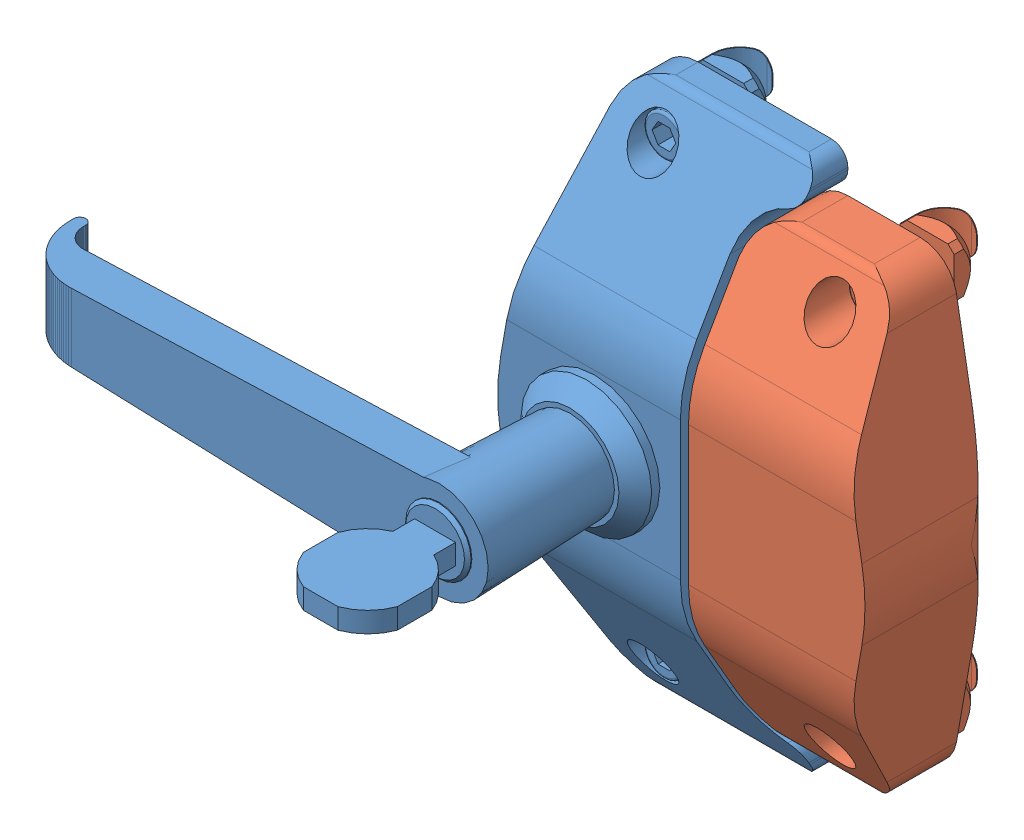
SolidWorks assembly 21.0958 SLIDING DOOR LATCH 45.sldasm, configuration Default (file format 6000). Lengths in mm.
Overall size (171.19 130 112.3).
2 component instances, 2 part files, 0 mates.
Components (placement in the parent):
- 21.0958 SLIDING DOOR LATCH HANDLE SIDE-1: 21.0958 SLIDING DOOR LATCH HANDLE SIDE.sldprt [Default] at origin size (164 130 112.3)
- 21.0958 SLIDING DOOR LATCH CATCH SIDE-1: 21.0958 SLIDING DOOR LATCH CATCH SIDE.sldprt [Default] at origin size (43.19 110 45.3)
